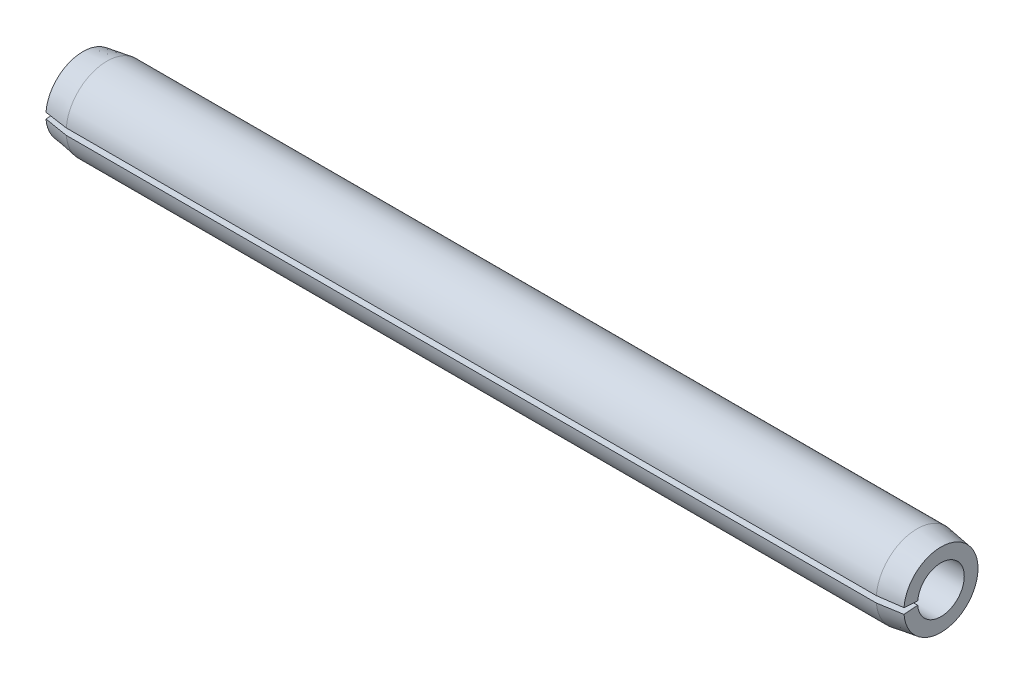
from build123d import *

# Parameters (mm, degrees)
GAP_DEPTH = 51.112676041


with BuildPart() as part:
    # Sketch1 → Base-Revolve (revolve)
    with BuildSketch(Plane.XY, mode=Mode.PRIVATE) as base_revolve_sk:
        Polygon((0, 1.3589), (50, 1.3589), (50, 2.159), (48.603, 2.3749), (1.397, 2.3749), (0, 2.159), align=None)
    revolve(base_revolve_sk.sketch.rotate(Axis((-9.525, 0, 0), (1, 0, 0)), 90), axis=Axis((-9.525, 0, 0), (1, 0, 0)))

    # Sketch2 → Gap (cut, through all)
    with BuildSketch(Plane(origin=(0, 0, 0), x_dir=(0, -1, 0), z_dir=(-1, 0, 0))):
        with BuildLine():
            Line((0, 0), (0.190059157, 2.414930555))
            ThreePointArc((0.190059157, 2.414930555), (0, 2.422398), (-0.190059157, 2.414930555))
            Line((-0.190059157, 2.414930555), (0, 0))
        make_face()
    extrude(amount=-GAP_DEPTH, mode=Mode.SUBTRACT)


solid = part.part
